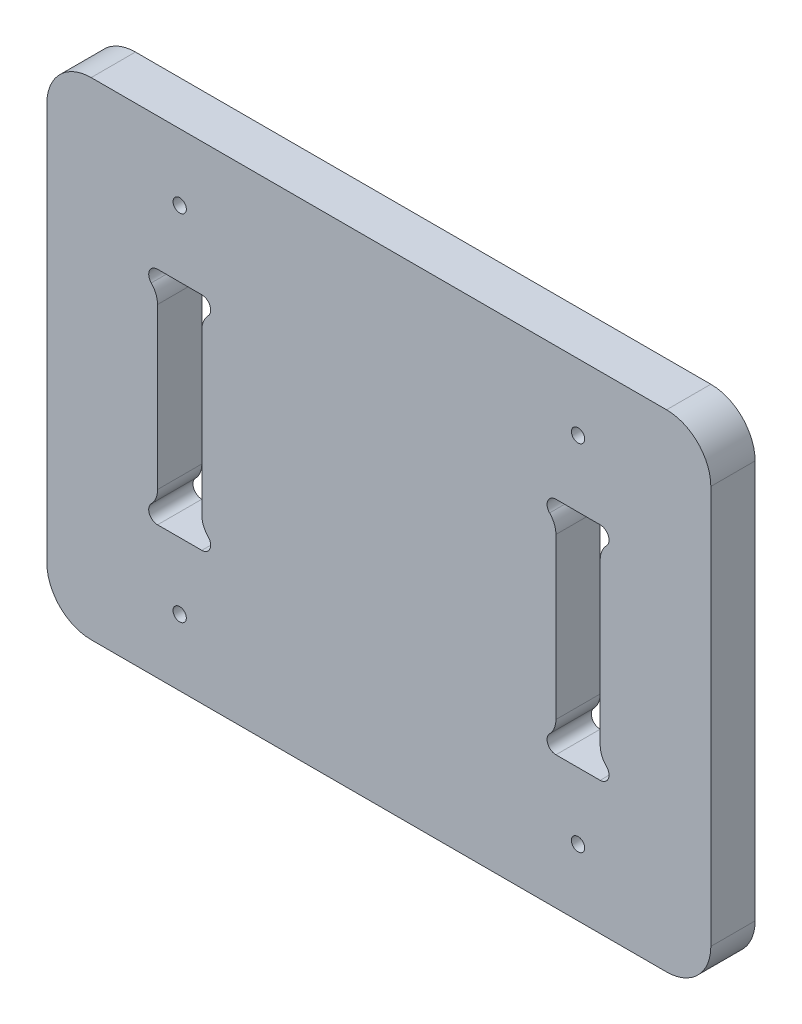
ISO-10303-21;
HEADER;
FILE_DESCRIPTION(('STEP AP214'),'2;1');
FILE_NAME('part.step','',(''),(''),'','','');
FILE_SCHEMA(('AUTOMOTIVE_DESIGN { 1 0 10303 214 1 1 1 1 }'));
ENDSEC;
DATA;
#1=APPLICATION_CONTEXT('core data for automotive mechanical design processes');
#2=APPLICATION_PROTOCOL_DEFINITION('international standard','automotive_design',2000,#1);
#3=PRODUCT_CONTEXT('',#1,'mechanical');
#4=PRODUCT('Part','Part','',(#3));
#5=PRODUCT_RELATED_PRODUCT_CATEGORY('part','',(#4));
#6=PRODUCT_DEFINITION_FORMATION('','',#4);
#7=PRODUCT_DEFINITION_CONTEXT('part definition',#1,'design');
#8=PRODUCT_DEFINITION('design','',#6,#7);
#9=PRODUCT_DEFINITION_SHAPE('','',#8);
#10=(LENGTH_UNIT() NAMED_UNIT(*) SI_UNIT(.MILLI.,.METRE.));
#11=(NAMED_UNIT(*) PLANE_ANGLE_UNIT() SI_UNIT($,.RADIAN.));
#12=(NAMED_UNIT(*) SI_UNIT($,.STERADIAN.) SOLID_ANGLE_UNIT());
#13=UNCERTAINTY_MEASURE_WITH_UNIT(LENGTH_MEASURE(1.E-05),#10,'distance_accuracy_value','');
#14=(GEOMETRIC_REPRESENTATION_CONTEXT(3) GLOBAL_UNCERTAINTY_ASSIGNED_CONTEXT((#13)) GLOBAL_UNIT_ASSIGNED_CONTEXT((#10,
#11,#12)) REPRESENTATION_CONTEXT('',''));
#15=CARTESIAN_POINT('',(0.,0.,0.));
#16=DIRECTION('',(0.,0.,1.));
#17=DIRECTION('',(1.,0.,0.));
#18=AXIS2_PLACEMENT_3D('',#15,#16,#17);
#19=CARTESIAN_POINT('',(9.99999999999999,100.,10.));
#20=DIRECTION('',(0.,0.,-1.));
#21=DIRECTION('',(-1.,0.,0.));
#22=AXIS2_PLACEMENT_3D('',#19,#20,#21);
#23=CYLINDRICAL_SURFACE('',#22,10.);
#24=CARTESIAN_POINT('',(9.99999999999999,100.,0.));
#25=DIRECTION('',(0.,0.,1.));
#26=DIRECTION('',(1.,0.,0.));
#27=AXIS2_PLACEMENT_3D('',#24,#25,#26);
#28=CIRCLE('',#27,10.);
#29=CARTESIAN_POINT('',(10.0000000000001,110.,0.));
#30=VERTEX_POINT('',#29);
#31=CARTESIAN_POINT('',(0.,99.9999999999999,0.));
#32=VERTEX_POINT('',#31);
#33=EDGE_CURVE('E492',#30,#32,#28,.T.);
#34=ORIENTED_EDGE('',*,*,#33,.T.);
#35=DIRECTION('',(0.,0.,-1.));
#36=VECTOR('',#35,1.);
#37=CARTESIAN_POINT('',(0.,99.9999999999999,10.));
#38=LINE('',#37,#36);
#39=CARTESIAN_POINT('',(0.,99.9999999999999,10.));
#40=VERTEX_POINT('',#39);
#41=EDGE_CURVE('E570',#40,#32,#38,.T.);
#42=ORIENTED_EDGE('',*,*,#41,.F.);
#43=CARTESIAN_POINT('',(9.99999999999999,100.,10.));
#44=DIRECTION('',(0.,0.,1.));
#45=DIRECTION('',(1.,0.,0.));
#46=AXIS2_PLACEMENT_3D('',#43,#44,#45);
#47=CIRCLE('',#46,10.);
#48=CARTESIAN_POINT('',(10.0000000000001,110.,10.));
#49=VERTEX_POINT('',#48);
#50=EDGE_CURVE('E493',#49,#40,#47,.T.);
#51=ORIENTED_EDGE('',*,*,#50,.F.);
#52=DIRECTION('',(0.,0.,-1.));
#53=VECTOR('',#52,1.);
#54=CARTESIAN_POINT('',(10.0000000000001,110.,10.));
#55=LINE('',#54,#53);
#56=EDGE_CURVE('E519',#49,#30,#55,.T.);
#57=ORIENTED_EDGE('',*,*,#56,.T.);
#58=EDGE_LOOP('',(#34,#42,#51,#57));
#59=FACE_BOUND('',#58,.T.);
#60=ADVANCED_FACE('F46',(#59),#23,.T.);
#61=CARTESIAN_POINT('',(0.,99.9999999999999,10.));
#62=DIRECTION('',(1.,0.,0.));
#63=DIRECTION('',(0.,1.,0.));
#64=AXIS2_PLACEMENT_3D('',#61,#62,#63);
#65=PLANE('',#64);
#66=DIRECTION('',(0.,-1.,0.));
#67=VECTOR('',#66,1.);
#68=CARTESIAN_POINT('',(0.,99.9999999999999,0.));
#69=LINE('',#68,#67);
#70=CARTESIAN_POINT('',(0.,10.0000000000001,0.));
#71=VERTEX_POINT('',#70);
#72=EDGE_CURVE('E523',#32,#71,#69,.T.);
#73=ORIENTED_EDGE('',*,*,#72,.T.);
#74=DIRECTION('',(0.,0.,-1.));
#75=VECTOR('',#74,1.);
#76=CARTESIAN_POINT('',(0.,10.0000000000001,10.));
#77=LINE('',#76,#75);
#78=CARTESIAN_POINT('',(0.,10.0000000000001,10.));
#79=VERTEX_POINT('',#78);
#80=EDGE_CURVE('E566',#79,#71,#77,.T.);
#81=ORIENTED_EDGE('',*,*,#80,.F.);
#82=DIRECTION('',(0.,-1.,0.));
#83=VECTOR('',#82,1.);
#84=CARTESIAN_POINT('',(0.,99.9999999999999,10.));
#85=LINE('',#84,#83);
#86=EDGE_CURVE('E497',#40,#79,#85,.T.);
#87=ORIENTED_EDGE('',*,*,#86,.F.);
#88=ORIENTED_EDGE('',*,*,#41,.T.);
#89=EDGE_LOOP('',(#73,#81,#87,#88));
#90=FACE_BOUND('',#89,.T.);
#91=ADVANCED_FACE('F624',(#90),#65,.F.);
#92=CARTESIAN_POINT('',(10.,10.,10.));
#93=DIRECTION('',(0.,0.,-1.));
#94=DIRECTION('',(-1.,0.,0.));
#95=AXIS2_PLACEMENT_3D('',#92,#93,#94);
#96=CYLINDRICAL_SURFACE('',#95,10.);
#97=CARTESIAN_POINT('',(10.,10.,0.));
#98=DIRECTION('',(0.,0.,1.));
#99=DIRECTION('',(1.,0.,0.));
#100=AXIS2_PLACEMENT_3D('',#97,#98,#99);
#101=CIRCLE('',#100,10.);
#102=CARTESIAN_POINT('',(10.0000000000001,0.,0.));
#103=VERTEX_POINT('',#102);
#104=EDGE_CURVE('E526',#71,#103,#101,.T.);
#105=ORIENTED_EDGE('',*,*,#104,.T.);
#106=DIRECTION('',(0.,0.,-1.));
#107=VECTOR('',#106,1.);
#108=CARTESIAN_POINT('',(10.0000000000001,0.,10.));
#109=LINE('',#108,#107);
#110=CARTESIAN_POINT('',(10.0000000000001,0.,10.));
#111=VERTEX_POINT('',#110);
#112=EDGE_CURVE('E562',#111,#103,#109,.T.);
#113=ORIENTED_EDGE('',*,*,#112,.F.);
#114=CARTESIAN_POINT('',(10.,10.,10.));
#115=DIRECTION('',(0.,0.,1.));
#116=DIRECTION('',(1.,0.,0.));
#117=AXIS2_PLACEMENT_3D('',#114,#115,#116);
#118=CIRCLE('',#117,10.);
#119=EDGE_CURVE('E501',#79,#111,#118,.T.);
#120=ORIENTED_EDGE('',*,*,#119,.F.);
#121=ORIENTED_EDGE('',*,*,#80,.T.);
#122=EDGE_LOOP('',(#105,#113,#120,#121));
#123=FACE_BOUND('',#122,.T.);
#124=ADVANCED_FACE('F630',(#123),#96,.T.);
#125=CARTESIAN_POINT('',(10.0000000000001,0.,10.));
#126=DIRECTION('',(0.,1.,0.));
#127=DIRECTION('',(0.,0.,1.));
#128=AXIS2_PLACEMENT_3D('',#125,#126,#127);
#129=PLANE('',#128);
#130=DIRECTION('',(1.,0.,0.));
#131=VECTOR('',#130,1.);
#132=CARTESIAN_POINT('',(10.0000000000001,0.,0.));
#133=LINE('',#132,#131);
#134=CARTESIAN_POINT('',(140.,0.,0.));
#135=VERTEX_POINT('',#134);
#136=EDGE_CURVE('E529',#103,#135,#133,.T.);
#137=ORIENTED_EDGE('',*,*,#136,.T.);
#138=DIRECTION('',(0.,0.,-1.));
#139=VECTOR('',#138,1.);
#140=CARTESIAN_POINT('',(140.,0.,10.));
#141=LINE('',#140,#139);
#142=CARTESIAN_POINT('',(140.,0.,10.));
#143=VERTEX_POINT('',#142);
#144=EDGE_CURVE('E558',#143,#135,#141,.T.);
#145=ORIENTED_EDGE('',*,*,#144,.F.);
#146=DIRECTION('',(1.,0.,0.));
#147=VECTOR('',#146,1.);
#148=CARTESIAN_POINT('',(10.0000000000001,0.,10.));
#149=LINE('',#148,#147);
#150=EDGE_CURVE('E504',#111,#143,#149,.T.);
#151=ORIENTED_EDGE('',*,*,#150,.F.);
#152=ORIENTED_EDGE('',*,*,#112,.T.);
#153=EDGE_LOOP('',(#137,#145,#151,#152));
#154=FACE_BOUND('',#153,.T.);
#155=ADVANCED_FACE('F684',(#154),#129,.F.);
#156=CARTESIAN_POINT('',(140.,10.,10.));
#157=DIRECTION('',(0.,0.,-1.));
#158=DIRECTION('',(-1.,0.,0.));
#159=AXIS2_PLACEMENT_3D('',#156,#157,#158);
#160=CYLINDRICAL_SURFACE('',#159,10.);
#161=CARTESIAN_POINT('',(140.,10.,0.));
#162=DIRECTION('',(0.,0.,1.));
#163=DIRECTION('',(1.,0.,0.));
#164=AXIS2_PLACEMENT_3D('',#161,#162,#163);
#165=CIRCLE('',#164,10.);
#166=CARTESIAN_POINT('',(150.,10.0000000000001,0.));
#167=VERTEX_POINT('',#166);
#168=EDGE_CURVE('E532',#135,#167,#165,.T.);
#169=ORIENTED_EDGE('',*,*,#168,.T.);
#170=DIRECTION('',(0.,0.,-1.));
#171=VECTOR('',#170,1.);
#172=CARTESIAN_POINT('',(150.,10.0000000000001,10.));
#173=LINE('',#172,#171);
#174=CARTESIAN_POINT('',(150.,10.0000000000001,10.));
#175=VERTEX_POINT('',#174);
#176=EDGE_CURVE('E554',#175,#167,#173,.T.);
#177=ORIENTED_EDGE('',*,*,#176,.F.);
#178=CARTESIAN_POINT('',(140.,10.,10.));
#179=DIRECTION('',(0.,0.,1.));
#180=DIRECTION('',(1.,0.,0.));
#181=AXIS2_PLACEMENT_3D('',#178,#179,#180);
#182=CIRCLE('',#181,10.);
#183=EDGE_CURVE('E507',#143,#175,#182,.T.);
#184=ORIENTED_EDGE('',*,*,#183,.F.);
#185=ORIENTED_EDGE('',*,*,#144,.T.);
#186=EDGE_LOOP('',(#169,#177,#184,#185));
#187=FACE_BOUND('',#186,.T.);
#188=ADVANCED_FACE('F688',(#187),#160,.T.);
#189=CARTESIAN_POINT('',(150.,99.9999999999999,10.));
#190=DIRECTION('',(-1.,0.,0.));
#191=DIRECTION('',(0.,0.,1.));
#192=AXIS2_PLACEMENT_3D('',#189,#190,#191);
#193=PLANE('',#192);
#194=DIRECTION('',(0.,1.,0.));
#195=VECTOR('',#194,1.);
#196=CARTESIAN_POINT('',(150.,99.9999999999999,0.));
#197=LINE('',#196,#195);
#198=CARTESIAN_POINT('',(150.,99.9999999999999,0.));
#199=VERTEX_POINT('',#198);
#200=EDGE_CURVE('E535',#167,#199,#197,.T.);
#201=ORIENTED_EDGE('',*,*,#200,.T.);
#202=DIRECTION('',(0.,0.,-1.));
#203=VECTOR('',#202,1.);
#204=CARTESIAN_POINT('',(150.,99.9999999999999,10.));
#205=LINE('',#204,#203);
#206=CARTESIAN_POINT('',(150.,99.9999999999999,10.));
#207=VERTEX_POINT('',#206);
#208=EDGE_CURVE('E550',#207,#199,#205,.T.);
#209=ORIENTED_EDGE('',*,*,#208,.F.);
#210=DIRECTION('',(0.,1.,0.));
#211=VECTOR('',#210,1.);
#212=CARTESIAN_POINT('',(150.,99.9999999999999,10.));
#213=LINE('',#212,#211);
#214=EDGE_CURVE('E510',#175,#207,#213,.T.);
#215=ORIENTED_EDGE('',*,*,#214,.F.);
#216=ORIENTED_EDGE('',*,*,#176,.T.);
#217=EDGE_LOOP('',(#201,#209,#215,#216));
#218=FACE_BOUND('',#217,.T.);
#219=ADVANCED_FACE('F693',(#218),#193,.F.);
#220=CARTESIAN_POINT('',(140.,100.,10.));
#221=DIRECTION('',(0.,0.,-1.));
#222=DIRECTION('',(-1.,0.,0.));
#223=AXIS2_PLACEMENT_3D('',#220,#221,#222);
#224=CYLINDRICAL_SURFACE('',#223,10.);
#225=CARTESIAN_POINT('',(140.,100.,0.));
#226=DIRECTION('',(0.,0.,1.));
#227=DIRECTION('',(-1.,0.,0.));
#228=AXIS2_PLACEMENT_3D('',#225,#226,#227);
#229=CIRCLE('',#228,10.);
#230=CARTESIAN_POINT('',(140.,110.,0.));
#231=VERTEX_POINT('',#230);
#232=EDGE_CURVE('E538',#199,#231,#229,.T.);
#233=ORIENTED_EDGE('',*,*,#232,.T.);
#234=DIRECTION('',(0.,0.,-1.));
#235=VECTOR('',#234,1.);
#236=CARTESIAN_POINT('',(140.,110.,10.));
#237=LINE('',#236,#235);
#238=CARTESIAN_POINT('',(140.,110.,10.));
#239=VERTEX_POINT('',#238);
#240=EDGE_CURVE('E546',#239,#231,#237,.T.);
#241=ORIENTED_EDGE('',*,*,#240,.F.);
#242=CARTESIAN_POINT('',(140.,100.,10.));
#243=DIRECTION('',(0.,0.,1.));
#244=DIRECTION('',(-1.,0.,0.));
#245=AXIS2_PLACEMENT_3D('',#242,#243,#244);
#246=CIRCLE('',#245,10.);
#247=EDGE_CURVE('E513',#207,#239,#246,.T.);
#248=ORIENTED_EDGE('',*,*,#247,.F.);
#249=ORIENTED_EDGE('',*,*,#208,.T.);
#250=EDGE_LOOP('',(#233,#241,#248,#249));
#251=FACE_BOUND('',#250,.T.);
#252=ADVANCED_FACE('F697',(#251),#224,.T.);
#253=CARTESIAN_POINT('',(10.0000000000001,110.,10.));
#254=DIRECTION('',(0.,-1.,0.));
#255=DIRECTION('',(0.,0.,-1.));
#256=AXIS2_PLACEMENT_3D('',#253,#254,#255);
#257=PLANE('',#256);
#258=DIRECTION('',(-1.,0.,0.));
#259=VECTOR('',#258,1.);
#260=CARTESIAN_POINT('',(10.0000000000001,110.,0.));
#261=LINE('',#260,#259);
#262=EDGE_CURVE('E498',#231,#30,#261,.T.);
#263=ORIENTED_EDGE('',*,*,#262,.T.);
#264=ORIENTED_EDGE('',*,*,#56,.F.);
#265=DIRECTION('',(-1.,0.,0.));
#266=VECTOR('',#265,1.);
#267=CARTESIAN_POINT('',(10.0000000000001,110.,10.));
#268=LINE('',#267,#266);
#269=EDGE_CURVE('E516',#239,#49,#268,.T.);
#270=ORIENTED_EDGE('',*,*,#269,.F.);
#271=ORIENTED_EDGE('',*,*,#240,.T.);
#272=EDGE_LOOP('',(#263,#264,#270,#271));
#273=FACE_BOUND('',#272,.T.);
#274=ADVANCED_FACE('F666',(#273),#257,.F.);
#275=CARTESIAN_POINT('',(9.99999999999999,100.,10.));
#276=DIRECTION('',(0.,0.,1.));
#277=DIRECTION('',(1.,0.,0.));
#278=AXIS2_PLACEMENT_3D('',#275,#276,#277);
#279=PLANE('',#278);
#280=DIRECTION('',(1.,0.,0.));
#281=VECTOR('',#280,1.);
#282=CARTESIAN_POINT('',(35.,30.,10.));
#283=LINE('',#282,#281);
#284=CARTESIAN_POINT('',(25.,30.,10.));
#285=VERTEX_POINT('',#284);
#286=CARTESIAN_POINT('',(35.,30.,10.));
#287=VERTEX_POINT('',#286);
#288=EDGE_CURVE('E353',#285,#287,#283,.T.);
#289=ORIENTED_EDGE('',*,*,#288,.F.);
#290=CARTESIAN_POINT('',(25.,32.,10.));
#291=DIRECTION('',(0.,0.,1.));
#292=DIRECTION('',(1.,0.,0.));
#293=AXIS2_PLACEMENT_3D('',#290,#291,#292);
#294=CIRCLE('',#293,2.);
#295=CARTESIAN_POINT('',(23.5714285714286,33.3997084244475,10.));
#296=VERTEX_POINT('',#295);
#297=EDGE_CURVE('E276',#296,#285,#294,.T.);
#298=ORIENTED_EDGE('',*,*,#297,.F.);
#299=CARTESIAN_POINT('',(20.,36.8989794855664,10.));
#300=DIRECTION('',(0.,0.,-1.));
#301=DIRECTION('',(1.,0.,0.));
#302=AXIS2_PLACEMENT_3D('',#299,#300,#301);
#303=CIRCLE('',#302,5.);
#304=CARTESIAN_POINT('',(25.,36.8989794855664,10.));
#305=VERTEX_POINT('',#304);
#306=EDGE_CURVE('E324',#305,#296,#303,.T.);
#307=ORIENTED_EDGE('',*,*,#306,.F.);
#308=DIRECTION('',(0.,-1.,0.));
#309=VECTOR('',#308,1.);
#310=CARTESIAN_POINT('',(25.,36.8989794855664,10.));
#311=LINE('',#310,#309);
#312=CARTESIAN_POINT('',(25.,73.1010205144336,10.));
#313=VERTEX_POINT('',#312);
#314=EDGE_CURVE('E262',#313,#305,#311,.T.);
#315=ORIENTED_EDGE('',*,*,#314,.F.);
#316=CARTESIAN_POINT('',(20.,73.1010205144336,10.));
#317=DIRECTION('',(0.,0.,-1.));
#318=DIRECTION('',(1.,0.,0.));
#319=AXIS2_PLACEMENT_3D('',#316,#317,#318);
#320=CIRCLE('',#319,5.);
#321=CARTESIAN_POINT('',(23.5714285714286,76.6002915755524,10.));
#322=VERTEX_POINT('',#321);
#323=EDGE_CURVE('E329',#322,#313,#320,.T.);
#324=ORIENTED_EDGE('',*,*,#323,.F.);
#325=CARTESIAN_POINT('',(25.,78.,10.));
#326=DIRECTION('',(0.,0.,1.));
#327=DIRECTION('',(1.,0.,0.));
#328=AXIS2_PLACEMENT_3D('',#325,#326,#327);
#329=CIRCLE('',#328,2.00000000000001);
#330=CARTESIAN_POINT('',(25.,80.,10.));
#331=VERTEX_POINT('',#330);
#332=EDGE_CURVE('E332',#331,#322,#329,.T.);
#333=ORIENTED_EDGE('',*,*,#332,.F.);
#334=DIRECTION('',(-1.,0.,0.));
#335=VECTOR('',#334,1.);
#336=CARTESIAN_POINT('',(25.,80.,10.));
#337=LINE('',#336,#335);
#338=CARTESIAN_POINT('',(35.,80.,10.));
#339=VERTEX_POINT('',#338);
#340=EDGE_CURVE('E335',#339,#331,#337,.T.);
#341=ORIENTED_EDGE('',*,*,#340,.F.);
#342=CARTESIAN_POINT('',(35.,78.,10.));
#343=DIRECTION('',(0.,0.,1.));
#344=DIRECTION('',(-1.,0.,0.));
#345=AXIS2_PLACEMENT_3D('',#342,#343,#344);
#346=CIRCLE('',#345,2.00000000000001);
#347=CARTESIAN_POINT('',(36.4285714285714,76.6002915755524,10.));
#348=VERTEX_POINT('',#347);
#349=EDGE_CURVE('E338',#348,#339,#346,.T.);
#350=ORIENTED_EDGE('',*,*,#349,.F.);
#351=CARTESIAN_POINT('',(40.,73.1010205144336,10.));
#352=DIRECTION('',(0.,0.,-1.));
#353=DIRECTION('',(-1.,0.,0.));
#354=AXIS2_PLACEMENT_3D('',#351,#352,#353);
#355=CIRCLE('',#354,5.);
#356=CARTESIAN_POINT('',(35.,73.1010205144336,10.));
#357=VERTEX_POINT('',#356);
#358=EDGE_CURVE('E341',#357,#348,#355,.T.);
#359=ORIENTED_EDGE('',*,*,#358,.F.);
#360=DIRECTION('',(0.,1.,0.));
#361=VECTOR('',#360,1.);
#362=CARTESIAN_POINT('',(35.,36.8989794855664,10.));
#363=LINE('',#362,#361);
#364=CARTESIAN_POINT('',(35.,36.8989794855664,10.));
#365=VERTEX_POINT('',#364);
#366=EDGE_CURVE('E344',#365,#357,#363,.T.);
#367=ORIENTED_EDGE('',*,*,#366,.F.);
#368=CARTESIAN_POINT('',(40.,36.8989794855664,10.));
#369=DIRECTION('',(0.,0.,-1.));
#370=DIRECTION('',(-1.,0.,0.));
#371=AXIS2_PLACEMENT_3D('',#368,#369,#370);
#372=CIRCLE('',#371,5.);
#373=CARTESIAN_POINT('',(36.4285714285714,33.3997084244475,10.));
#374=VERTEX_POINT('',#373);
#375=EDGE_CURVE('E347',#374,#365,#372,.T.);
#376=ORIENTED_EDGE('',*,*,#375,.F.);
#377=CARTESIAN_POINT('',(35.,32.,10.));
#378=DIRECTION('',(0.,0.,1.));
#379=DIRECTION('',(-1.,0.,0.));
#380=AXIS2_PLACEMENT_3D('',#377,#378,#379);
#381=CIRCLE('',#380,2.);
#382=EDGE_CURVE('E350',#287,#374,#381,.T.);
#383=ORIENTED_EDGE('',*,*,#382,.F.);
#384=EDGE_LOOP('',(#289,#298,#307,#315,#324,#333,#341,#350,#359,#367,#376,#383));
#385=FACE_BOUND('',#384,.T.);
#386=CARTESIAN_POINT('',(30.,15.,10.));
#387=DIRECTION('',(0.,0.,1.));
#388=DIRECTION('',(1.,0.,0.));
#389=AXIS2_PLACEMENT_3D('',#386,#387,#388);
#390=CIRCLE('',#389,1.5);
#391=CARTESIAN_POINT('',(31.5,15.,10.));
#392=VERTEX_POINT('',#391);
#393=EDGE_CURVE('E358',#392,#392,#390,.T.);
#394=ORIENTED_EDGE('',*,*,#393,.F.);
#395=EDGE_LOOP('',(#394));
#396=FACE_BOUND('',#395,.T.);
#397=CARTESIAN_POINT('',(120.,95.,10.));
#398=DIRECTION('',(0.,0.,1.));
#399=DIRECTION('',(-1.,0.,0.));
#400=AXIS2_PLACEMENT_3D('',#397,#398,#399);
#401=CIRCLE('',#400,1.5);
#402=CARTESIAN_POINT('',(118.5,95.,10.));
#403=VERTEX_POINT('',#402);
#404=EDGE_CURVE('E363',#403,#403,#401,.T.);
#405=ORIENTED_EDGE('',*,*,#404,.F.);
#406=EDGE_LOOP('',(#405));
#407=FACE_BOUND('',#406,.T.);
#408=DIRECTION('',(1.,0.,0.));
#409=VECTOR('',#408,1.);
#410=CARTESIAN_POINT('',(125.,30.,10.));
#411=LINE('',#410,#409);
#412=CARTESIAN_POINT('',(115.,30.,10.));
#413=VERTEX_POINT('',#412);
#414=CARTESIAN_POINT('',(125.,30.,10.));
#415=VERTEX_POINT('',#414);
#416=EDGE_CURVE('E484',#413,#415,#411,.T.);
#417=ORIENTED_EDGE('',*,*,#416,.F.);
#418=CARTESIAN_POINT('',(115.,32.,10.));
#419=DIRECTION('',(0.,0.,1.));
#420=DIRECTION('',(1.,0.,0.));
#421=AXIS2_PLACEMENT_3D('',#418,#419,#420);
#422=CIRCLE('',#421,2.);
#423=CARTESIAN_POINT('',(113.571428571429,33.3997084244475,10.));
#424=VERTEX_POINT('',#423);
#425=EDGE_CURVE('E412',#424,#413,#422,.T.);
#426=ORIENTED_EDGE('',*,*,#425,.F.);
#427=CARTESIAN_POINT('',(110.,36.8989794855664,10.));
#428=DIRECTION('',(0.,0.,-1.));
#429=DIRECTION('',(1.,0.,0.));
#430=AXIS2_PLACEMENT_3D('',#427,#428,#429);
#431=CIRCLE('',#430,5.);
#432=CARTESIAN_POINT('',(115.,36.8989794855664,10.));
#433=VERTEX_POINT('',#432);
#434=EDGE_CURVE('E406',#433,#424,#431,.T.);
#435=ORIENTED_EDGE('',*,*,#434,.F.);
#436=DIRECTION('',(0.,-1.,0.));
#437=VECTOR('',#436,1.);
#438=CARTESIAN_POINT('',(115.,36.8989794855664,10.));
#439=LINE('',#438,#437);
#440=CARTESIAN_POINT('',(115.,73.1010205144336,10.));
#441=VERTEX_POINT('',#440);
#442=EDGE_CURVE('E457',#441,#433,#439,.T.);
#443=ORIENTED_EDGE('',*,*,#442,.F.);
#444=CARTESIAN_POINT('',(110.,73.1010205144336,10.));
#445=DIRECTION('',(0.,0.,-1.));
#446=DIRECTION('',(1.,0.,0.));
#447=AXIS2_PLACEMENT_3D('',#444,#445,#446);
#448=CIRCLE('',#447,5.00000000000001);
#449=CARTESIAN_POINT('',(113.571428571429,76.6002915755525,10.));
#450=VERTEX_POINT('',#449);
#451=EDGE_CURVE('E460',#450,#441,#448,.T.);
#452=ORIENTED_EDGE('',*,*,#451,.F.);
#453=CARTESIAN_POINT('',(115.,78.,10.));
#454=DIRECTION('',(0.,0.,1.));
#455=DIRECTION('',(1.,0.,0.));
#456=AXIS2_PLACEMENT_3D('',#453,#454,#455);
#457=CIRCLE('',#456,1.99999999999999);
#458=CARTESIAN_POINT('',(115.,80.,10.));
#459=VERTEX_POINT('',#458);
#460=EDGE_CURVE('E463',#459,#450,#457,.T.);
#461=ORIENTED_EDGE('',*,*,#460,.F.);
#462=DIRECTION('',(-1.,0.,0.));
#463=VECTOR('',#462,1.);
#464=CARTESIAN_POINT('',(115.,80.,10.));
#465=LINE('',#464,#463);
#466=CARTESIAN_POINT('',(125.,80.,10.));
#467=VERTEX_POINT('',#466);
#468=EDGE_CURVE('E466',#467,#459,#465,.T.);
#469=ORIENTED_EDGE('',*,*,#468,.F.);
#470=CARTESIAN_POINT('',(125.,78.,10.));
#471=DIRECTION('',(0.,0.,1.));
#472=DIRECTION('',(-1.,0.,0.));
#473=AXIS2_PLACEMENT_3D('',#470,#471,#472);
#474=CIRCLE('',#473,1.99999999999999);
#475=CARTESIAN_POINT('',(126.428571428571,76.6002915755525,10.));
#476=VERTEX_POINT('',#475);
#477=EDGE_CURVE('E469',#476,#467,#474,.T.);
#478=ORIENTED_EDGE('',*,*,#477,.F.);
#479=CARTESIAN_POINT('',(130.,73.1010205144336,10.));
#480=DIRECTION('',(0.,0.,-1.));
#481=DIRECTION('',(-1.,0.,0.));
#482=AXIS2_PLACEMENT_3D('',#479,#480,#481);
#483=CIRCLE('',#482,5.00000000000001);
#484=CARTESIAN_POINT('',(125.,73.1010205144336,10.));
#485=VERTEX_POINT('',#484);
#486=EDGE_CURVE('E472',#485,#476,#483,.T.);
#487=ORIENTED_EDGE('',*,*,#486,.F.);
#488=DIRECTION('',(0.,1.,0.));
#489=VECTOR('',#488,1.);
#490=CARTESIAN_POINT('',(125.,36.8989794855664,10.));
#491=LINE('',#490,#489);
#492=CARTESIAN_POINT('',(125.,36.8989794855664,10.));
#493=VERTEX_POINT('',#492);
#494=EDGE_CURVE('E475',#493,#485,#491,.T.);
#495=ORIENTED_EDGE('',*,*,#494,.F.);
#496=CARTESIAN_POINT('',(130.,36.8989794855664,10.));
#497=DIRECTION('',(0.,0.,-1.));
#498=DIRECTION('',(-1.,0.,0.));
#499=AXIS2_PLACEMENT_3D('',#496,#497,#498);
#500=CIRCLE('',#499,5.00000000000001);
#501=CARTESIAN_POINT('',(126.428571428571,33.3997084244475,10.));
#502=VERTEX_POINT('',#501);
#503=EDGE_CURVE('E478',#502,#493,#500,.T.);
#504=ORIENTED_EDGE('',*,*,#503,.F.);
#505=CARTESIAN_POINT('',(125.,32.,10.));
#506=DIRECTION('',(0.,0.,1.));
#507=DIRECTION('',(-1.,0.,0.));
#508=AXIS2_PLACEMENT_3D('',#505,#506,#507);
#509=CIRCLE('',#508,2.);
#510=EDGE_CURVE('E481',#415,#502,#509,.T.);
#511=ORIENTED_EDGE('',*,*,#510,.F.);
#512=EDGE_LOOP('',(#417,#426,#435,#443,#452,#461,#469,#478,#487,#495,#504,#511));
#513=FACE_BOUND('',#512,.T.);
#514=CARTESIAN_POINT('',(120.,15.,10.));
#515=DIRECTION('',(0.,0.,1.));
#516=DIRECTION('',(1.,0.,0.));
#517=AXIS2_PLACEMENT_3D('',#514,#515,#516);
#518=CIRCLE('',#517,1.50000000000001);
#519=CARTESIAN_POINT('',(121.5,15.,10.));
#520=VERTEX_POINT('',#519);
#521=EDGE_CURVE('E373',#520,#520,#518,.T.);
#522=ORIENTED_EDGE('',*,*,#521,.F.);
#523=EDGE_LOOP('',(#522));
#524=FACE_BOUND('',#523,.T.);
#525=CARTESIAN_POINT('',(30.,95.,10.));
#526=DIRECTION('',(0.,0.,1.));
#527=DIRECTION('',(-1.,0.,0.));
#528=AXIS2_PLACEMENT_3D('',#525,#526,#527);
#529=CIRCLE('',#528,1.5);
#530=CARTESIAN_POINT('',(28.5,95.,10.));
#531=VERTEX_POINT('',#530);
#532=EDGE_CURVE('E323',#531,#531,#529,.T.);
#533=ORIENTED_EDGE('',*,*,#532,.F.);
#534=EDGE_LOOP('',(#533));
#535=FACE_BOUND('',#534,.T.);
#536=ORIENTED_EDGE('',*,*,#50,.T.);
#537=ORIENTED_EDGE('',*,*,#86,.T.);
#538=ORIENTED_EDGE('',*,*,#119,.T.);
#539=ORIENTED_EDGE('',*,*,#150,.T.);
#540=ORIENTED_EDGE('',*,*,#183,.T.);
#541=ORIENTED_EDGE('',*,*,#214,.T.);
#542=ORIENTED_EDGE('',*,*,#247,.T.);
#543=ORIENTED_EDGE('',*,*,#269,.T.);
#544=EDGE_LOOP('',(#536,#537,#538,#539,#540,#541,#542,#543));
#545=FACE_BOUND('',#544,.T.);
#546=ADVANCED_FACE('F613',(#385,#396,#407,#513,#524,#535,#545),#279,.T.);
#547=CARTESIAN_POINT('',(9.99999999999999,100.,0.));
#548=DIRECTION('',(0.,0.,1.));
#549=DIRECTION('',(1.,0.,0.));
#550=AXIS2_PLACEMENT_3D('',#547,#548,#549);
#551=PLANE('',#550);
#552=CARTESIAN_POINT('',(120.,95.,0.));
#553=DIRECTION('',(0.,0.,1.));
#554=DIRECTION('',(1.,0.,0.));
#555=AXIS2_PLACEMENT_3D('',#552,#553,#554);
#556=CIRCLE('',#555,3.70000000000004);
#557=CARTESIAN_POINT('',(123.7,95.,0.));
#558=VERTEX_POINT('',#557);
#559=EDGE_CURVE('E586',#558,#558,#556,.T.);
#560=ORIENTED_EDGE('',*,*,#559,.T.);
#561=EDGE_LOOP('',(#560));
#562=FACE_BOUND('',#561,.T.);
#563=CARTESIAN_POINT('',(30.,95.,0.));
#564=DIRECTION('',(0.,0.,1.));
#565=DIRECTION('',(1.,0.,0.));
#566=AXIS2_PLACEMENT_3D('',#563,#564,#565);
#567=CIRCLE('',#566,3.70000000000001);
#568=CARTESIAN_POINT('',(33.7,95.,0.));
#569=VERTEX_POINT('',#568);
#570=EDGE_CURVE('E582',#569,#569,#567,.T.);
#571=ORIENTED_EDGE('',*,*,#570,.T.);
#572=EDGE_LOOP('',(#571));
#573=FACE_BOUND('',#572,.T.);
#574=CARTESIAN_POINT('',(120.,15.,0.));
#575=DIRECTION('',(0.,0.,1.));
#576=DIRECTION('',(1.,0.,0.));
#577=AXIS2_PLACEMENT_3D('',#574,#575,#576);
#578=CIRCLE('',#577,3.70000000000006);
#579=CARTESIAN_POINT('',(123.7,15.,0.));
#580=VERTEX_POINT('',#579);
#581=EDGE_CURVE('E578',#580,#580,#578,.T.);
#582=ORIENTED_EDGE('',*,*,#581,.T.);
#583=EDGE_LOOP('',(#582));
#584=FACE_BOUND('',#583,.T.);
#585=CARTESIAN_POINT('',(30.,15.,0.));
#586=DIRECTION('',(0.,0.,1.));
#587=DIRECTION('',(1.,0.,0.));
#588=AXIS2_PLACEMENT_3D('',#585,#586,#587);
#589=CIRCLE('',#588,3.70000000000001);
#590=CARTESIAN_POINT('',(33.7,15.,0.));
#591=VERTEX_POINT('',#590);
#592=EDGE_CURVE('E574',#591,#591,#589,.T.);
#593=ORIENTED_EDGE('',*,*,#592,.T.);
#594=EDGE_LOOP('',(#593));
#595=FACE_BOUND('',#594,.T.);
#596=CARTESIAN_POINT('',(25.,32.,0.));
#597=DIRECTION('',(0.,0.,1.));
#598=DIRECTION('',(1.,0.,0.));
#599=AXIS2_PLACEMENT_3D('',#596,#597,#598);
#600=CIRCLE('',#599,2.);
#601=CARTESIAN_POINT('',(23.5714285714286,33.3997084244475,0.));
#602=VERTEX_POINT('',#601);
#603=CARTESIAN_POINT('',(25.,30.,0.));
#604=VERTEX_POINT('',#603);
#605=EDGE_CURVE('E320',#602,#604,#600,.T.);
#606=ORIENTED_EDGE('',*,*,#605,.T.);
#607=DIRECTION('',(1.,0.,0.));
#608=VECTOR('',#607,1.);
#609=CARTESIAN_POINT('',(35.,30.,0.));
#610=LINE('',#609,#608);
#611=CARTESIAN_POINT('',(35.,30.,0.));
#612=VERTEX_POINT('',#611);
#613=EDGE_CURVE('E316',#604,#612,#610,.T.);
#614=ORIENTED_EDGE('',*,*,#613,.T.);
#615=CARTESIAN_POINT('',(35.,32.,0.));
#616=DIRECTION('',(0.,0.,1.));
#617=DIRECTION('',(-1.,0.,0.));
#618=AXIS2_PLACEMENT_3D('',#615,#616,#617);
#619=CIRCLE('',#618,2.);
#620=CARTESIAN_POINT('',(36.4285714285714,33.3997084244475,0.));
#621=VERTEX_POINT('',#620);
#622=EDGE_CURVE('E312',#612,#621,#619,.T.);
#623=ORIENTED_EDGE('',*,*,#622,.T.);
#624=CARTESIAN_POINT('',(40.,36.8989794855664,0.));
#625=DIRECTION('',(0.,0.,-1.));
#626=DIRECTION('',(-1.,0.,0.));
#627=AXIS2_PLACEMENT_3D('',#624,#625,#626);
#628=CIRCLE('',#627,5.);
#629=CARTESIAN_POINT('',(35.,36.8989794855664,0.));
#630=VERTEX_POINT('',#629);
#631=EDGE_CURVE('E308',#621,#630,#628,.T.);
#632=ORIENTED_EDGE('',*,*,#631,.T.);
#633=DIRECTION('',(0.,1.,0.));
#634=VECTOR('',#633,1.);
#635=CARTESIAN_POINT('',(35.,36.8989794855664,0.));
#636=LINE('',#635,#634);
#637=CARTESIAN_POINT('',(35.,73.1010205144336,0.));
#638=VERTEX_POINT('',#637);
#639=EDGE_CURVE('E304',#630,#638,#636,.T.);
#640=ORIENTED_EDGE('',*,*,#639,.T.);
#641=CARTESIAN_POINT('',(40.,73.1010205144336,0.));
#642=DIRECTION('',(0.,0.,-1.));
#643=DIRECTION('',(-1.,0.,0.));
#644=AXIS2_PLACEMENT_3D('',#641,#642,#643);
#645=CIRCLE('',#644,5.);
#646=CARTESIAN_POINT('',(36.4285714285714,76.6002915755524,0.));
#647=VERTEX_POINT('',#646);
#648=EDGE_CURVE('E300',#638,#647,#645,.T.);
#649=ORIENTED_EDGE('',*,*,#648,.T.);
#650=CARTESIAN_POINT('',(35.,78.,0.));
#651=DIRECTION('',(0.,0.,1.));
#652=DIRECTION('',(-1.,0.,0.));
#653=AXIS2_PLACEMENT_3D('',#650,#651,#652);
#654=CIRCLE('',#653,2.00000000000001);
#655=CARTESIAN_POINT('',(35.,80.,0.));
#656=VERTEX_POINT('',#655);
#657=EDGE_CURVE('E296',#647,#656,#654,.T.);
#658=ORIENTED_EDGE('',*,*,#657,.T.);
#659=DIRECTION('',(-1.,0.,0.));
#660=VECTOR('',#659,1.);
#661=CARTESIAN_POINT('',(25.,80.,0.));
#662=LINE('',#661,#660);
#663=CARTESIAN_POINT('',(25.,80.,0.));
#664=VERTEX_POINT('',#663);
#665=EDGE_CURVE('E292',#656,#664,#662,.T.);
#666=ORIENTED_EDGE('',*,*,#665,.T.);
#667=CARTESIAN_POINT('',(25.,78.,0.));
#668=DIRECTION('',(0.,0.,1.));
#669=DIRECTION('',(1.,0.,0.));
#670=AXIS2_PLACEMENT_3D('',#667,#668,#669);
#671=CIRCLE('',#670,2.00000000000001);
#672=CARTESIAN_POINT('',(23.5714285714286,76.6002915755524,0.));
#673=VERTEX_POINT('',#672);
#674=EDGE_CURVE('E286',#664,#673,#671,.T.);
#675=ORIENTED_EDGE('',*,*,#674,.T.);
#676=CARTESIAN_POINT('',(20.,73.1010205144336,0.));
#677=DIRECTION('',(0.,0.,-1.));
#678=DIRECTION('',(1.,0.,0.));
#679=AXIS2_PLACEMENT_3D('',#676,#677,#678);
#680=CIRCLE('',#679,5.);
#681=CARTESIAN_POINT('',(25.,73.1010205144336,0.));
#682=VERTEX_POINT('',#681);
#683=EDGE_CURVE('E282',#673,#682,#680,.T.);
#684=ORIENTED_EDGE('',*,*,#683,.T.);
#685=DIRECTION('',(0.,-1.,0.));
#686=VECTOR('',#685,1.);
#687=CARTESIAN_POINT('',(25.,36.8989794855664,0.));
#688=LINE('',#687,#686);
#689=CARTESIAN_POINT('',(25.,36.8989794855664,0.));
#690=VERTEX_POINT('',#689);
#691=EDGE_CURVE('E259',#682,#690,#688,.T.);
#692=ORIENTED_EDGE('',*,*,#691,.T.);
#693=CARTESIAN_POINT('',(20.,36.8989794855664,0.));
#694=DIRECTION('',(0.,0.,-1.));
#695=DIRECTION('',(1.,0.,0.));
#696=AXIS2_PLACEMENT_3D('',#693,#694,#695);
#697=CIRCLE('',#696,5.);
#698=EDGE_CURVE('E270',#690,#602,#697,.T.);
#699=ORIENTED_EDGE('',*,*,#698,.T.);
#700=EDGE_LOOP('',(#606,#614,#623,#632,#640,#649,#658,#666,#675,#684,#692,#699));
#701=FACE_BOUND('',#700,.T.);
#702=CARTESIAN_POINT('',(115.,32.,0.));
#703=DIRECTION('',(0.,0.,1.));
#704=DIRECTION('',(1.,0.,0.));
#705=AXIS2_PLACEMENT_3D('',#702,#703,#704);
#706=CIRCLE('',#705,2.);
#707=CARTESIAN_POINT('',(113.571428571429,33.3997084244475,0.));
#708=VERTEX_POINT('',#707);
#709=CARTESIAN_POINT('',(115.,30.,0.));
#710=VERTEX_POINT('',#709);
#711=EDGE_CURVE('E367',#708,#710,#706,.T.);
#712=ORIENTED_EDGE('',*,*,#711,.T.);
#713=DIRECTION('',(1.,0.,0.));
#714=VECTOR('',#713,1.);
#715=CARTESIAN_POINT('',(125.,30.,0.));
#716=LINE('',#715,#714);
#717=CARTESIAN_POINT('',(125.,30.,0.));
#718=VERTEX_POINT('',#717);
#719=EDGE_CURVE('E448',#710,#718,#716,.T.);
#720=ORIENTED_EDGE('',*,*,#719,.T.);
#721=CARTESIAN_POINT('',(125.,32.,0.));
#722=DIRECTION('',(0.,0.,1.));
#723=DIRECTION('',(-1.,0.,0.));
#724=AXIS2_PLACEMENT_3D('',#721,#722,#723);
#725=CIRCLE('',#724,2.);
#726=CARTESIAN_POINT('',(126.428571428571,33.3997084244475,0.));
#727=VERTEX_POINT('',#726);
#728=EDGE_CURVE('E444',#718,#727,#725,.T.);
#729=ORIENTED_EDGE('',*,*,#728,.T.);
#730=CARTESIAN_POINT('',(130.,36.8989794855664,0.));
#731=DIRECTION('',(0.,0.,-1.));
#732=DIRECTION('',(-1.,0.,0.));
#733=AXIS2_PLACEMENT_3D('',#730,#731,#732);
#734=CIRCLE('',#733,5.00000000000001);
#735=CARTESIAN_POINT('',(125.,36.8989794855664,0.));
#736=VERTEX_POINT('',#735);
#737=EDGE_CURVE('E440',#727,#736,#734,.T.);
#738=ORIENTED_EDGE('',*,*,#737,.T.);
#739=DIRECTION('',(0.,1.,0.));
#740=VECTOR('',#739,1.);
#741=CARTESIAN_POINT('',(125.,36.8989794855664,0.));
#742=LINE('',#741,#740);
#743=CARTESIAN_POINT('',(125.,73.1010205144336,0.));
#744=VERTEX_POINT('',#743);
#745=EDGE_CURVE('E436',#736,#744,#742,.T.);
#746=ORIENTED_EDGE('',*,*,#745,.T.);
#747=CARTESIAN_POINT('',(130.,73.1010205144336,0.));
#748=DIRECTION('',(0.,0.,-1.));
#749=DIRECTION('',(-1.,0.,0.));
#750=AXIS2_PLACEMENT_3D('',#747,#748,#749);
#751=CIRCLE('',#750,5.00000000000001);
#752=CARTESIAN_POINT('',(126.428571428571,76.6002915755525,0.));
#753=VERTEX_POINT('',#752);
#754=EDGE_CURVE('E432',#744,#753,#751,.T.);
#755=ORIENTED_EDGE('',*,*,#754,.T.);
#756=CARTESIAN_POINT('',(125.,78.,0.));
#757=DIRECTION('',(0.,0.,1.));
#758=DIRECTION('',(-1.,0.,0.));
#759=AXIS2_PLACEMENT_3D('',#756,#757,#758);
#760=CIRCLE('',#759,1.99999999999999);
#761=CARTESIAN_POINT('',(125.,80.,0.));
#762=VERTEX_POINT('',#761);
#763=EDGE_CURVE('E428',#753,#762,#760,.T.);
#764=ORIENTED_EDGE('',*,*,#763,.T.);
#765=DIRECTION('',(-1.,0.,0.));
#766=VECTOR('',#765,1.);
#767=CARTESIAN_POINT('',(115.,80.,0.));
#768=LINE('',#767,#766);
#769=CARTESIAN_POINT('',(115.,80.,0.));
#770=VERTEX_POINT('',#769);
#771=EDGE_CURVE('E424',#762,#770,#768,.T.);
#772=ORIENTED_EDGE('',*,*,#771,.T.);
#773=CARTESIAN_POINT('',(115.,78.,0.));
#774=DIRECTION('',(0.,0.,1.));
#775=DIRECTION('',(1.,0.,0.));
#776=AXIS2_PLACEMENT_3D('',#773,#774,#775);
#777=CIRCLE('',#776,1.99999999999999);
#778=CARTESIAN_POINT('',(113.571428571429,76.6002915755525,0.));
#779=VERTEX_POINT('',#778);
#780=EDGE_CURVE('E420',#770,#779,#777,.T.);
#781=ORIENTED_EDGE('',*,*,#780,.T.);
#782=CARTESIAN_POINT('',(110.,73.1010205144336,0.));
#783=DIRECTION('',(0.,0.,-1.));
#784=DIRECTION('',(1.,0.,0.));
#785=AXIS2_PLACEMENT_3D('',#782,#783,#784);
#786=CIRCLE('',#785,5.00000000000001);
#787=CARTESIAN_POINT('',(115.,73.1010205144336,0.));
#788=VERTEX_POINT('',#787);
#789=EDGE_CURVE('E416',#779,#788,#786,.T.);
#790=ORIENTED_EDGE('',*,*,#789,.T.);
#791=DIRECTION('',(0.,-1.,0.));
#792=VECTOR('',#791,1.);
#793=CARTESIAN_POINT('',(115.,36.8989794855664,0.));
#794=LINE('',#793,#792);
#795=CARTESIAN_POINT('',(115.,36.8989794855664,0.));
#796=VERTEX_POINT('',#795);
#797=EDGE_CURVE('E411',#788,#796,#794,.T.);
#798=ORIENTED_EDGE('',*,*,#797,.T.);
#799=CARTESIAN_POINT('',(110.,36.8989794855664,0.));
#800=DIRECTION('',(0.,0.,-1.));
#801=DIRECTION('',(1.,0.,0.));
#802=AXIS2_PLACEMENT_3D('',#799,#800,#801);
#803=CIRCLE('',#802,5.);
#804=EDGE_CURVE('E407',#796,#708,#803,.T.);
#805=ORIENTED_EDGE('',*,*,#804,.T.);
#806=EDGE_LOOP('',(#712,#720,#729,#738,#746,#755,#764,#772,#781,#790,#798,#805));
#807=FACE_BOUND('',#806,.T.);
#808=ORIENTED_EDGE('',*,*,#33,.F.);
#809=ORIENTED_EDGE('',*,*,#262,.F.);
#810=ORIENTED_EDGE('',*,*,#232,.F.);
#811=ORIENTED_EDGE('',*,*,#200,.F.);
#812=ORIENTED_EDGE('',*,*,#168,.F.);
#813=ORIENTED_EDGE('',*,*,#136,.F.);
#814=ORIENTED_EDGE('',*,*,#104,.F.);
#815=ORIENTED_EDGE('',*,*,#72,.F.);
#816=EDGE_LOOP('',(#808,#809,#810,#811,#812,#813,#814,#815));
#817=FACE_BOUND('',#816,.T.);
#818=ADVANCED_FACE('F278',(#562,#573,#584,#595,#701,#807,#817),#551,.F.);
#819=CARTESIAN_POINT('',(30.,95.,10.));
#820=DIRECTION('',(0.,0.,-1.));
#821=DIRECTION('',(-1.,0.,0.));
#822=AXIS2_PLACEMENT_3D('',#819,#820,#821);
#823=CYLINDRICAL_SURFACE('',#822,1.5);
#824=CARTESIAN_POINT('',(30.,95.,2.20000000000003));
#825=DIRECTION('',(0.,0.,1.));
#826=DIRECTION('',(1.,0.,0.));
#827=AXIS2_PLACEMENT_3D('',#824,#825,#826);
#828=CIRCLE('',#827,1.5);
#829=CARTESIAN_POINT('',(31.5,95.,2.20000000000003));
#830=VERTEX_POINT('',#829);
#831=EDGE_CURVE('E594',#830,#830,#828,.F.);
#832=ORIENTED_EDGE('',*,*,#831,.T.);
#833=EDGE_LOOP('',(#832));
#834=FACE_BOUND('',#833,.T.);
#835=ORIENTED_EDGE('',*,*,#532,.T.);
#836=EDGE_LOOP('',(#835));
#837=FACE_BOUND('',#836,.T.);
#838=ADVANCED_FACE('F612',(#834,#837),#823,.F.);
#839=CARTESIAN_POINT('',(120.,15.,10.));
#840=DIRECTION('',(0.,0.,-1.));
#841=DIRECTION('',(-1.,0.,0.));
#842=AXIS2_PLACEMENT_3D('',#839,#840,#841);
#843=CYLINDRICAL_SURFACE('',#842,1.50000000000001);
#844=CARTESIAN_POINT('',(120.,15.,2.20000000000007));
#845=DIRECTION('',(0.,0.,1.));
#846=DIRECTION('',(1.,0.,0.));
#847=AXIS2_PLACEMENT_3D('',#844,#845,#846);
#848=CIRCLE('',#847,1.50000000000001);
#849=CARTESIAN_POINT('',(121.5,15.,2.20000000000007));
#850=VERTEX_POINT('',#849);
#851=EDGE_CURVE('E56',#850,#850,#848,.F.);
#852=ORIENTED_EDGE('',*,*,#851,.T.);
#853=EDGE_LOOP('',(#852));
#854=FACE_BOUND('',#853,.T.);
#855=ORIENTED_EDGE('',*,*,#521,.T.);
#856=EDGE_LOOP('',(#855));
#857=FACE_BOUND('',#856,.T.);
#858=ADVANCED_FACE('F601',(#854,#857),#843,.F.);
#859=CARTESIAN_POINT('',(115.,32.,10.));
#860=DIRECTION('',(0.,0.,-1.));
#861=DIRECTION('',(-1.,0.,0.));
#862=AXIS2_PLACEMENT_3D('',#859,#860,#861);
#863=CYLINDRICAL_SURFACE('',#862,2.);
#864=ORIENTED_EDGE('',*,*,#711,.F.);
#865=DIRECTION('',(0.,0.,-1.));
#866=VECTOR('',#865,1.);
#867=CARTESIAN_POINT('',(113.571428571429,33.3997084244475,10.));
#868=LINE('',#867,#866);
#869=EDGE_CURVE('E402',#424,#708,#868,.T.);
#870=ORIENTED_EDGE('',*,*,#869,.F.);
#871=ORIENTED_EDGE('',*,*,#425,.T.);
#872=DIRECTION('',(0.,0.,-1.));
#873=VECTOR('',#872,1.);
#874=CARTESIAN_POINT('',(115.,30.,10.));
#875=LINE('',#874,#873);
#876=EDGE_CURVE('E368',#413,#710,#875,.T.);
#877=ORIENTED_EDGE('',*,*,#876,.T.);
#878=EDGE_LOOP('',(#864,#870,#871,#877));
#879=FACE_BOUND('',#878,.T.);
#880=ADVANCED_FACE('F773',(#879),#863,.F.);
#881=CARTESIAN_POINT('',(125.,30.,10.));
#882=DIRECTION('',(0.,1.,0.));
#883=DIRECTION('',(0.,0.,1.));
#884=AXIS2_PLACEMENT_3D('',#881,#882,#883);
#885=PLANE('',#884);
#886=ORIENTED_EDGE('',*,*,#719,.F.);
#887=ORIENTED_EDGE('',*,*,#876,.F.);
#888=ORIENTED_EDGE('',*,*,#416,.T.);
#889=DIRECTION('',(0.,0.,-1.));
#890=VECTOR('',#889,1.);
#891=CARTESIAN_POINT('',(125.,30.,10.));
#892=LINE('',#891,#890);
#893=EDGE_CURVE('E372',#415,#718,#892,.T.);
#894=ORIENTED_EDGE('',*,*,#893,.T.);
#895=EDGE_LOOP('',(#886,#887,#888,#894));
#896=FACE_BOUND('',#895,.T.);
#897=ADVANCED_FACE('F782',(#896),#885,.T.);
#898=CARTESIAN_POINT('',(125.,32.,10.));
#899=DIRECTION('',(0.,0.,-1.));
#900=DIRECTION('',(-1.,0.,0.));
#901=AXIS2_PLACEMENT_3D('',#898,#899,#900);
#902=CYLINDRICAL_SURFACE('',#901,2.);
#903=ORIENTED_EDGE('',*,*,#728,.F.);
#904=ORIENTED_EDGE('',*,*,#893,.F.);
#905=ORIENTED_EDGE('',*,*,#510,.T.);
#906=DIRECTION('',(0.,0.,-1.));
#907=VECTOR('',#906,1.);
#908=CARTESIAN_POINT('',(126.428571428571,33.3997084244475,10.));
#909=LINE('',#908,#907);
#910=EDGE_CURVE('E376',#502,#727,#909,.T.);
#911=ORIENTED_EDGE('',*,*,#910,.T.);
#912=EDGE_LOOP('',(#903,#904,#905,#911));
#913=FACE_BOUND('',#912,.T.);
#914=ADVANCED_FACE('F792',(#913),#902,.F.);
#915=CARTESIAN_POINT('',(130.,36.8989794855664,10.));
#916=DIRECTION('',(0.,0.,-1.));
#917=DIRECTION('',(-1.,0.,0.));
#918=AXIS2_PLACEMENT_3D('',#915,#916,#917);
#919=CYLINDRICAL_SURFACE('',#918,5.00000000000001);
#920=ORIENTED_EDGE('',*,*,#737,.F.);
#921=ORIENTED_EDGE('',*,*,#910,.F.);
#922=ORIENTED_EDGE('',*,*,#503,.T.);
#923=DIRECTION('',(0.,0.,-1.));
#924=VECTOR('',#923,1.);
#925=CARTESIAN_POINT('',(125.,36.8989794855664,10.));
#926=LINE('',#925,#924);
#927=EDGE_CURVE('E379',#493,#736,#926,.T.);
#928=ORIENTED_EDGE('',*,*,#927,.T.);
#929=EDGE_LOOP('',(#920,#921,#922,#928));
#930=FACE_BOUND('',#929,.T.);
#931=ADVANCED_FACE('F802',(#930),#919,.T.);
#932=CARTESIAN_POINT('',(125.,36.8989794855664,10.));
#933=DIRECTION('',(-1.,0.,0.));
#934=DIRECTION('',(0.,0.,1.));
#935=AXIS2_PLACEMENT_3D('',#932,#933,#934);
#936=PLANE('',#935);
#937=ORIENTED_EDGE('',*,*,#745,.F.);
#938=ORIENTED_EDGE('',*,*,#927,.F.);
#939=ORIENTED_EDGE('',*,*,#494,.T.);
#940=DIRECTION('',(0.,0.,-1.));
#941=VECTOR('',#940,1.);
#942=CARTESIAN_POINT('',(125.,73.1010205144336,10.));
#943=LINE('',#942,#941);
#944=EDGE_CURVE('E382',#485,#744,#943,.T.);
#945=ORIENTED_EDGE('',*,*,#944,.T.);
#946=EDGE_LOOP('',(#937,#938,#939,#945));
#947=FACE_BOUND('',#946,.T.);
#948=ADVANCED_FACE('F812',(#947),#936,.T.);
#949=CARTESIAN_POINT('',(130.,73.1010205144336,10.));
#950=DIRECTION('',(0.,0.,-1.));
#951=DIRECTION('',(-1.,0.,0.));
#952=AXIS2_PLACEMENT_3D('',#949,#950,#951);
#953=CYLINDRICAL_SURFACE('',#952,5.00000000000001);
#954=ORIENTED_EDGE('',*,*,#754,.F.);
#955=ORIENTED_EDGE('',*,*,#944,.F.);
#956=ORIENTED_EDGE('',*,*,#486,.T.);
#957=DIRECTION('',(0.,0.,-1.));
#958=VECTOR('',#957,1.);
#959=CARTESIAN_POINT('',(126.428571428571,76.6002915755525,10.));
#960=LINE('',#959,#958);
#961=EDGE_CURVE('E385',#476,#753,#960,.T.);
#962=ORIENTED_EDGE('',*,*,#961,.T.);
#963=EDGE_LOOP('',(#954,#955,#956,#962));
#964=FACE_BOUND('',#963,.T.);
#965=ADVANCED_FACE('F822',(#964),#953,.T.);
#966=CARTESIAN_POINT('',(125.,78.,10.));
#967=DIRECTION('',(0.,0.,-1.));
#968=DIRECTION('',(-1.,0.,0.));
#969=AXIS2_PLACEMENT_3D('',#966,#967,#968);
#970=CYLINDRICAL_SURFACE('',#969,1.99999999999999);
#971=ORIENTED_EDGE('',*,*,#763,.F.);
#972=ORIENTED_EDGE('',*,*,#961,.F.);
#973=ORIENTED_EDGE('',*,*,#477,.T.);
#974=DIRECTION('',(0.,0.,-1.));
#975=VECTOR('',#974,1.);
#976=CARTESIAN_POINT('',(125.,80.,10.));
#977=LINE('',#976,#975);
#978=EDGE_CURVE('E388',#467,#762,#977,.T.);
#979=ORIENTED_EDGE('',*,*,#978,.T.);
#980=EDGE_LOOP('',(#971,#972,#973,#979));
#981=FACE_BOUND('',#980,.T.);
#982=ADVANCED_FACE('F832',(#981),#970,.F.);
#983=CARTESIAN_POINT('',(115.,80.,10.));
#984=DIRECTION('',(0.,-1.,0.));
#985=DIRECTION('',(0.,0.,-1.));
#986=AXIS2_PLACEMENT_3D('',#983,#984,#985);
#987=PLANE('',#986);
#988=ORIENTED_EDGE('',*,*,#771,.F.);
#989=ORIENTED_EDGE('',*,*,#978,.F.);
#990=ORIENTED_EDGE('',*,*,#468,.T.);
#991=DIRECTION('',(0.,0.,-1.));
#992=VECTOR('',#991,1.);
#993=CARTESIAN_POINT('',(115.,80.,10.));
#994=LINE('',#993,#992);
#995=EDGE_CURVE('E391',#459,#770,#994,.T.);
#996=ORIENTED_EDGE('',*,*,#995,.T.);
#997=EDGE_LOOP('',(#988,#989,#990,#996));
#998=FACE_BOUND('',#997,.T.);
#999=ADVANCED_FACE('F842',(#998),#987,.T.);
#1000=CARTESIAN_POINT('',(115.,78.,10.));
#1001=DIRECTION('',(0.,0.,-1.));
#1002=DIRECTION('',(-1.,0.,0.));
#1003=AXIS2_PLACEMENT_3D('',#1000,#1001,#1002);
#1004=CYLINDRICAL_SURFACE('',#1003,1.99999999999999);
#1005=ORIENTED_EDGE('',*,*,#780,.F.);
#1006=ORIENTED_EDGE('',*,*,#995,.F.);
#1007=ORIENTED_EDGE('',*,*,#460,.T.);
#1008=DIRECTION('',(0.,0.,-1.));
#1009=VECTOR('',#1008,1.);
#1010=CARTESIAN_POINT('',(113.571428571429,76.6002915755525,10.));
#1011=LINE('',#1010,#1009);
#1012=EDGE_CURVE('E394',#450,#779,#1011,.T.);
#1013=ORIENTED_EDGE('',*,*,#1012,.T.);
#1014=EDGE_LOOP('',(#1005,#1006,#1007,#1013));
#1015=FACE_BOUND('',#1014,.T.);
#1016=ADVANCED_FACE('F852',(#1015),#1004,.F.);
#1017=CARTESIAN_POINT('',(110.,73.1010205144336,10.));
#1018=DIRECTION('',(0.,0.,-1.));
#1019=DIRECTION('',(-1.,0.,0.));
#1020=AXIS2_PLACEMENT_3D('',#1017,#1018,#1019);
#1021=CYLINDRICAL_SURFACE('',#1020,5.00000000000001);
#1022=ORIENTED_EDGE('',*,*,#789,.F.);
#1023=ORIENTED_EDGE('',*,*,#1012,.F.);
#1024=ORIENTED_EDGE('',*,*,#451,.T.);
#1025=DIRECTION('',(0.,0.,-1.));
#1026=VECTOR('',#1025,1.);
#1027=CARTESIAN_POINT('',(115.,73.1010205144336,10.));
#1028=LINE('',#1027,#1026);
#1029=EDGE_CURVE('E397',#441,#788,#1028,.T.);
#1030=ORIENTED_EDGE('',*,*,#1029,.T.);
#1031=EDGE_LOOP('',(#1022,#1023,#1024,#1030));
#1032=FACE_BOUND('',#1031,.T.);
#1033=ADVANCED_FACE('F862',(#1032),#1021,.T.);
#1034=CARTESIAN_POINT('',(115.,36.8989794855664,10.));
#1035=DIRECTION('',(1.,0.,0.));
#1036=DIRECTION('',(0.,1.,0.));
#1037=AXIS2_PLACEMENT_3D('',#1034,#1035,#1036);
#1038=PLANE('',#1037);
#1039=ORIENTED_EDGE('',*,*,#797,.F.);
#1040=ORIENTED_EDGE('',*,*,#1029,.F.);
#1041=ORIENTED_EDGE('',*,*,#442,.T.);
#1042=DIRECTION('',(0.,0.,-1.));
#1043=VECTOR('',#1042,1.);
#1044=CARTESIAN_POINT('',(115.,36.8989794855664,10.));
#1045=LINE('',#1044,#1043);
#1046=EDGE_CURVE('E71',#433,#796,#1045,.T.);
#1047=ORIENTED_EDGE('',*,*,#1046,.T.);
#1048=EDGE_LOOP('',(#1039,#1040,#1041,#1047));
#1049=FACE_BOUND('',#1048,.T.);
#1050=ADVANCED_FACE('F872',(#1049),#1038,.T.);
#1051=CARTESIAN_POINT('',(110.,36.8989794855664,10.));
#1052=DIRECTION('',(0.,0.,-1.));
#1053=DIRECTION('',(-1.,0.,0.));
#1054=AXIS2_PLACEMENT_3D('',#1051,#1052,#1053);
#1055=CYLINDRICAL_SURFACE('',#1054,5.);
#1056=ORIENTED_EDGE('',*,*,#804,.F.);
#1057=ORIENTED_EDGE('',*,*,#1046,.F.);
#1058=ORIENTED_EDGE('',*,*,#434,.T.);
#1059=ORIENTED_EDGE('',*,*,#869,.T.);
#1060=EDGE_LOOP('',(#1056,#1057,#1058,#1059));
#1061=FACE_BOUND('',#1060,.T.);
#1062=ADVANCED_FACE('F882',(#1061),#1055,.T.);
#1063=CARTESIAN_POINT('',(120.,95.,10.));
#1064=DIRECTION('',(0.,0.,-1.));
#1065=DIRECTION('',(-1.,0.,0.));
#1066=AXIS2_PLACEMENT_3D('',#1063,#1064,#1065);
#1067=CYLINDRICAL_SURFACE('',#1066,1.5);
#1068=CARTESIAN_POINT('',(120.,95.,2.20000000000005));
#1069=DIRECTION('',(0.,0.,1.));
#1070=DIRECTION('',(1.,0.,0.));
#1071=AXIS2_PLACEMENT_3D('',#1068,#1069,#1070);
#1072=CIRCLE('',#1071,1.5);
#1073=CARTESIAN_POINT('',(121.5,95.,2.20000000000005));
#1074=VERTEX_POINT('',#1073);
#1075=EDGE_CURVE('E590',#1074,#1074,#1072,.F.);
#1076=ORIENTED_EDGE('',*,*,#1075,.T.);
#1077=EDGE_LOOP('',(#1076));
#1078=FACE_BOUND('',#1077,.T.);
#1079=ORIENTED_EDGE('',*,*,#404,.T.);
#1080=EDGE_LOOP('',(#1079));
#1081=FACE_BOUND('',#1080,.T.);
#1082=ADVANCED_FACE('F892',(#1078,#1081),#1067,.F.);
#1083=CARTESIAN_POINT('',(30.,15.,10.));
#1084=DIRECTION('',(0.,0.,-1.));
#1085=DIRECTION('',(-1.,0.,0.));
#1086=AXIS2_PLACEMENT_3D('',#1083,#1084,#1085);
#1087=CYLINDRICAL_SURFACE('',#1086,1.5);
#1088=CARTESIAN_POINT('',(30.,15.,2.20000000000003));
#1089=DIRECTION('',(0.,0.,1.));
#1090=DIRECTION('',(1.,0.,0.));
#1091=AXIS2_PLACEMENT_3D('',#1088,#1089,#1090);
#1092=CIRCLE('',#1091,1.5);
#1093=CARTESIAN_POINT('',(31.5,15.,2.20000000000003));
#1094=VERTEX_POINT('',#1093);
#1095=EDGE_CURVE('E11',#1094,#1094,#1092,.F.);
#1096=ORIENTED_EDGE('',*,*,#1095,.T.);
#1097=EDGE_LOOP('',(#1096));
#1098=FACE_BOUND('',#1097,.T.);
#1099=ORIENTED_EDGE('',*,*,#393,.T.);
#1100=EDGE_LOOP('',(#1099));
#1101=FACE_BOUND('',#1100,.T.);
#1102=ADVANCED_FACE('F901',(#1098,#1101),#1087,.F.);
#1103=CARTESIAN_POINT('',(25.,32.,10.));
#1104=DIRECTION('',(0.,0.,-1.));
#1105=DIRECTION('',(-1.,0.,0.));
#1106=AXIS2_PLACEMENT_3D('',#1103,#1104,#1105);
#1107=CYLINDRICAL_SURFACE('',#1106,2.);
#1108=ORIENTED_EDGE('',*,*,#605,.F.);
#1109=DIRECTION('',(0.,0.,-1.));
#1110=VECTOR('',#1109,1.);
#1111=CARTESIAN_POINT('',(23.5714285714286,33.3997084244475,10.));
#1112=LINE('',#1111,#1110);
#1113=EDGE_CURVE('E265',#296,#602,#1112,.T.);
#1114=ORIENTED_EDGE('',*,*,#1113,.F.);
#1115=ORIENTED_EDGE('',*,*,#297,.T.);
#1116=DIRECTION('',(0.,0.,-1.));
#1117=VECTOR('',#1116,1.);
#1118=CARTESIAN_POINT('',(25.,30.,10.));
#1119=LINE('',#1118,#1117);
#1120=EDGE_CURVE('E362',#285,#604,#1119,.T.);
#1121=ORIENTED_EDGE('',*,*,#1120,.T.);
#1122=EDGE_LOOP('',(#1108,#1114,#1115,#1121));
#1123=FACE_BOUND('',#1122,.T.);
#1124=ADVANCED_FACE('F911',(#1123),#1107,.F.);
#1125=CARTESIAN_POINT('',(35.,30.,10.));
#1126=DIRECTION('',(0.,1.,0.));
#1127=DIRECTION('',(0.,0.,1.));
#1128=AXIS2_PLACEMENT_3D('',#1125,#1126,#1127);
#1129=PLANE('',#1128);
#1130=ORIENTED_EDGE('',*,*,#613,.F.);
#1131=ORIENTED_EDGE('',*,*,#1120,.F.);
#1132=ORIENTED_EDGE('',*,*,#288,.T.);
#1133=DIRECTION('',(0.,0.,-1.));
#1134=VECTOR('',#1133,1.);
#1135=CARTESIAN_POINT('',(35.,30.,10.));
#1136=LINE('',#1135,#1134);
#1137=EDGE_CURVE('E1079',#287,#612,#1136,.T.);
#1138=ORIENTED_EDGE('',*,*,#1137,.T.);
#1139=EDGE_LOOP('',(#1130,#1131,#1132,#1138));
#1140=FACE_BOUND('',#1139,.T.);
#1141=ADVANCED_FACE('F920',(#1140),#1129,.T.);
#1142=CARTESIAN_POINT('',(35.,32.,10.));
#1143=DIRECTION('',(0.,0.,-1.));
#1144=DIRECTION('',(-1.,0.,0.));
#1145=AXIS2_PLACEMENT_3D('',#1142,#1143,#1144);
#1146=CYLINDRICAL_SURFACE('',#1145,2.);
#1147=ORIENTED_EDGE('',*,*,#622,.F.);
#1148=ORIENTED_EDGE('',*,*,#1137,.F.);
#1149=ORIENTED_EDGE('',*,*,#382,.T.);
#1150=DIRECTION('',(0.,0.,-1.));
#1151=VECTOR('',#1150,1.);
#1152=CARTESIAN_POINT('',(36.4285714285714,33.3997084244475,10.));
#1153=LINE('',#1152,#1151);
#1154=EDGE_CURVE('E1076',#374,#621,#1153,.T.);
#1155=ORIENTED_EDGE('',*,*,#1154,.T.);
#1156=EDGE_LOOP('',(#1147,#1148,#1149,#1155));
#1157=FACE_BOUND('',#1156,.T.);
#1158=ADVANCED_FACE('F930',(#1157),#1146,.F.);
#1159=CARTESIAN_POINT('',(40.,36.8989794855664,10.));
#1160=DIRECTION('',(0.,0.,-1.));
#1161=DIRECTION('',(-1.,0.,0.));
#1162=AXIS2_PLACEMENT_3D('',#1159,#1160,#1161);
#1163=CYLINDRICAL_SURFACE('',#1162,5.);
#1164=ORIENTED_EDGE('',*,*,#631,.F.);
#1165=ORIENTED_EDGE('',*,*,#1154,.F.);
#1166=ORIENTED_EDGE('',*,*,#375,.T.);
#1167=DIRECTION('',(0.,0.,-1.));
#1168=VECTOR('',#1167,1.);
#1169=CARTESIAN_POINT('',(35.,36.8989794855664,10.));
#1170=LINE('',#1169,#1168);
#1171=EDGE_CURVE('E1073',#365,#630,#1170,.T.);
#1172=ORIENTED_EDGE('',*,*,#1171,.T.);
#1173=EDGE_LOOP('',(#1164,#1165,#1166,#1172));
#1174=FACE_BOUND('',#1173,.T.);
#1175=ADVANCED_FACE('F940',(#1174),#1163,.T.);
#1176=CARTESIAN_POINT('',(35.,36.8989794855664,10.));
#1177=DIRECTION('',(-1.,0.,0.));
#1178=DIRECTION('',(0.,0.,1.));
#1179=AXIS2_PLACEMENT_3D('',#1176,#1177,#1178);
#1180=PLANE('',#1179);
#1181=ORIENTED_EDGE('',*,*,#639,.F.);
#1182=ORIENTED_EDGE('',*,*,#1171,.F.);
#1183=ORIENTED_EDGE('',*,*,#366,.T.);
#1184=DIRECTION('',(0.,0.,-1.));
#1185=VECTOR('',#1184,1.);
#1186=CARTESIAN_POINT('',(35.,73.1010205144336,10.));
#1187=LINE('',#1186,#1185);
#1188=EDGE_CURVE('E1070',#357,#638,#1187,.T.);
#1189=ORIENTED_EDGE('',*,*,#1188,.T.);
#1190=EDGE_LOOP('',(#1181,#1182,#1183,#1189));
#1191=FACE_BOUND('',#1190,.T.);
#1192=ADVANCED_FACE('F950',(#1191),#1180,.T.);
#1193=CARTESIAN_POINT('',(40.,73.1010205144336,10.));
#1194=DIRECTION('',(0.,0.,-1.));
#1195=DIRECTION('',(-1.,0.,0.));
#1196=AXIS2_PLACEMENT_3D('',#1193,#1194,#1195);
#1197=CYLINDRICAL_SURFACE('',#1196,5.);
#1198=ORIENTED_EDGE('',*,*,#648,.F.);
#1199=ORIENTED_EDGE('',*,*,#1188,.F.);
#1200=ORIENTED_EDGE('',*,*,#358,.T.);
#1201=DIRECTION('',(0.,0.,-1.));
#1202=VECTOR('',#1201,1.);
#1203=CARTESIAN_POINT('',(36.4285714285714,76.6002915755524,10.));
#1204=LINE('',#1203,#1202);
#1205=EDGE_CURVE('E1067',#348,#647,#1204,.T.);
#1206=ORIENTED_EDGE('',*,*,#1205,.T.);
#1207=EDGE_LOOP('',(#1198,#1199,#1200,#1206));
#1208=FACE_BOUND('',#1207,.T.);
#1209=ADVANCED_FACE('F960',(#1208),#1197,.T.);
#1210=CARTESIAN_POINT('',(35.,78.,10.));
#1211=DIRECTION('',(0.,0.,-1.));
#1212=DIRECTION('',(-1.,0.,0.));
#1213=AXIS2_PLACEMENT_3D('',#1210,#1211,#1212);
#1214=CYLINDRICAL_SURFACE('',#1213,2.00000000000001);
#1215=ORIENTED_EDGE('',*,*,#657,.F.);
#1216=ORIENTED_EDGE('',*,*,#1205,.F.);
#1217=ORIENTED_EDGE('',*,*,#349,.T.);
#1218=DIRECTION('',(0.,0.,-1.));
#1219=VECTOR('',#1218,1.);
#1220=CARTESIAN_POINT('',(35.,80.,10.));
#1221=LINE('',#1220,#1219);
#1222=EDGE_CURVE('E1061',#339,#656,#1221,.T.);
#1223=ORIENTED_EDGE('',*,*,#1222,.T.);
#1224=EDGE_LOOP('',(#1215,#1216,#1217,#1223));
#1225=FACE_BOUND('',#1224,.T.);
#1226=ADVANCED_FACE('F970',(#1225),#1214,.F.);
#1227=CARTESIAN_POINT('',(25.,80.,10.));
#1228=DIRECTION('',(0.,-1.,0.));
#1229=DIRECTION('',(0.,0.,-1.));
#1230=AXIS2_PLACEMENT_3D('',#1227,#1228,#1229);
#1231=PLANE('',#1230);
#1232=ORIENTED_EDGE('',*,*,#665,.F.);
#1233=ORIENTED_EDGE('',*,*,#1222,.F.);
#1234=ORIENTED_EDGE('',*,*,#340,.T.);
#1235=DIRECTION('',(0.,0.,-1.));
#1236=VECTOR('',#1235,1.);
#1237=CARTESIAN_POINT('',(25.,80.,10.));
#1238=LINE('',#1237,#1236);
#1239=EDGE_CURVE('E1054',#331,#664,#1238,.T.);
#1240=ORIENTED_EDGE('',*,*,#1239,.T.);
#1241=EDGE_LOOP('',(#1232,#1233,#1234,#1240));
#1242=FACE_BOUND('',#1241,.T.);
#1243=ADVANCED_FACE('F980',(#1242),#1231,.T.);
#1244=CARTESIAN_POINT('',(25.,78.,10.));
#1245=DIRECTION('',(0.,0.,-1.));
#1246=DIRECTION('',(-1.,0.,0.));
#1247=AXIS2_PLACEMENT_3D('',#1244,#1245,#1246);
#1248=CYLINDRICAL_SURFACE('',#1247,2.00000000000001);
#1249=ORIENTED_EDGE('',*,*,#674,.F.);
#1250=ORIENTED_EDGE('',*,*,#1239,.F.);
#1251=ORIENTED_EDGE('',*,*,#332,.T.);
#1252=DIRECTION('',(0.,0.,-1.));
#1253=VECTOR('',#1252,1.);
#1254=CARTESIAN_POINT('',(23.5714285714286,76.6002915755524,10.));
#1255=LINE('',#1254,#1253);
#1256=EDGE_CURVE('E1049',#322,#673,#1255,.T.);
#1257=ORIENTED_EDGE('',*,*,#1256,.T.);
#1258=EDGE_LOOP('',(#1249,#1250,#1251,#1257));
#1259=FACE_BOUND('',#1258,.T.);
#1260=ADVANCED_FACE('F990',(#1259),#1248,.F.);
#1261=CARTESIAN_POINT('',(20.,73.1010205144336,10.));
#1262=DIRECTION('',(0.,0.,-1.));
#1263=DIRECTION('',(-1.,0.,0.));
#1264=AXIS2_PLACEMENT_3D('',#1261,#1262,#1263);
#1265=CYLINDRICAL_SURFACE('',#1264,5.);
#1266=ORIENTED_EDGE('',*,*,#683,.F.);
#1267=ORIENTED_EDGE('',*,*,#1256,.F.);
#1268=ORIENTED_EDGE('',*,*,#323,.T.);
#1269=DIRECTION('',(0.,0.,-1.));
#1270=VECTOR('',#1269,1.);
#1271=CARTESIAN_POINT('',(25.,73.1010205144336,10.));
#1272=LINE('',#1271,#1270);
#1273=EDGE_CURVE('E266',#313,#682,#1272,.T.);
#1274=ORIENTED_EDGE('',*,*,#1273,.T.);
#1275=EDGE_LOOP('',(#1266,#1267,#1268,#1274));
#1276=FACE_BOUND('',#1275,.T.);
#1277=ADVANCED_FACE('F1000',(#1276),#1265,.T.);
#1278=CARTESIAN_POINT('',(25.,36.8989794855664,10.));
#1279=DIRECTION('',(1.,0.,0.));
#1280=DIRECTION('',(0.,1.,0.));
#1281=AXIS2_PLACEMENT_3D('',#1278,#1279,#1280);
#1282=PLANE('',#1281);
#1283=ORIENTED_EDGE('',*,*,#691,.F.);
#1284=ORIENTED_EDGE('',*,*,#1273,.F.);
#1285=ORIENTED_EDGE('',*,*,#314,.T.);
#1286=DIRECTION('',(0.,0.,-1.));
#1287=VECTOR('',#1286,1.);
#1288=CARTESIAN_POINT('',(25.,36.8989794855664,10.));
#1289=LINE('',#1288,#1287);
#1290=EDGE_CURVE('E63',#305,#690,#1289,.T.);
#1291=ORIENTED_EDGE('',*,*,#1290,.T.);
#1292=EDGE_LOOP('',(#1283,#1284,#1285,#1291));
#1293=FACE_BOUND('',#1292,.T.);
#1294=ADVANCED_FACE('F256',(#1293),#1282,.T.);
#1295=CARTESIAN_POINT('',(20.,36.8989794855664,10.));
#1296=DIRECTION('',(0.,0.,-1.));
#1297=DIRECTION('',(-1.,0.,0.));
#1298=AXIS2_PLACEMENT_3D('',#1295,#1296,#1297);
#1299=CYLINDRICAL_SURFACE('',#1298,5.);
#1300=ORIENTED_EDGE('',*,*,#698,.F.);
#1301=ORIENTED_EDGE('',*,*,#1290,.F.);
#1302=ORIENTED_EDGE('',*,*,#306,.T.);
#1303=ORIENTED_EDGE('',*,*,#1113,.T.);
#1304=EDGE_LOOP('',(#1300,#1301,#1302,#1303));
#1305=FACE_BOUND('',#1304,.T.);
#1306=ADVANCED_FACE('F271',(#1305),#1299,.T.);
#1307=CARTESIAN_POINT('',(120.,95.,0.));
#1308=DIRECTION('',(0.,0.,-1.));
#1309=DIRECTION('',(-1.,0.,0.));
#1310=AXIS2_PLACEMENT_3D('',#1307,#1308,#1309);
#1311=CONICAL_SURFACE('',#1310,3.70000000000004,0.785398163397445);
#1312=ORIENTED_EDGE('',*,*,#1075,.F.);
#1313=EDGE_LOOP('',(#1312));
#1314=FACE_BOUND('',#1313,.T.);
#1315=ORIENTED_EDGE('',*,*,#559,.F.);
#1316=EDGE_LOOP('',(#1315));
#1317=FACE_BOUND('',#1316,.T.);
#1318=ADVANCED_FACE('F636',(#1314,#1317),#1311,.F.);
#1319=CARTESIAN_POINT('',(30.,95.,0.));
#1320=DIRECTION('',(0.,0.,-1.));
#1321=DIRECTION('',(-1.,0.,0.));
#1322=AXIS2_PLACEMENT_3D('',#1319,#1320,#1321);
#1323=CONICAL_SURFACE('',#1322,3.70000000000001,0.785398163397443);
#1324=ORIENTED_EDGE('',*,*,#831,.F.);
#1325=EDGE_LOOP('',(#1324));
#1326=FACE_BOUND('',#1325,.T.);
#1327=ORIENTED_EDGE('',*,*,#570,.F.);
#1328=EDGE_LOOP('',(#1327));
#1329=FACE_BOUND('',#1328,.T.);
#1330=ADVANCED_FACE('F607',(#1326,#1329),#1323,.F.);
#1331=CARTESIAN_POINT('',(120.,15.,0.));
#1332=DIRECTION('',(0.,0.,-1.));
#1333=DIRECTION('',(-1.,0.,0.));
#1334=AXIS2_PLACEMENT_3D('',#1331,#1332,#1333);
#1335=CONICAL_SURFACE('',#1334,3.70000000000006,0.785398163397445);
#1336=ORIENTED_EDGE('',*,*,#851,.F.);
#1337=EDGE_LOOP('',(#1336));
#1338=FACE_BOUND('',#1337,.T.);
#1339=ORIENTED_EDGE('',*,*,#581,.F.);
#1340=EDGE_LOOP('',(#1339));
#1341=FACE_BOUND('',#1340,.T.);
#1342=ADVANCED_FACE('F604',(#1338,#1341),#1335,.F.);
#1343=CARTESIAN_POINT('',(30.,15.,0.));
#1344=DIRECTION('',(0.,0.,-1.));
#1345=DIRECTION('',(-1.,0.,0.));
#1346=AXIS2_PLACEMENT_3D('',#1343,#1344,#1345);
#1347=CONICAL_SURFACE('',#1346,3.70000000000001,0.785398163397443);
#1348=ORIENTED_EDGE('',*,*,#1095,.F.);
#1349=EDGE_LOOP('',(#1348));
#1350=FACE_BOUND('',#1349,.T.);
#1351=ORIENTED_EDGE('',*,*,#592,.F.);
#1352=EDGE_LOOP('',(#1351));
#1353=FACE_BOUND('',#1352,.T.);
#1354=ADVANCED_FACE('F49',(#1350,#1353),#1347,.F.);
#1355=CLOSED_SHELL('',(#60,#91,#124,#155,#188,#219,#252,#274,#546,#818,#838,#858,#880,#897,#914,
#931,#948,#965,#982,#999,#1016,#1033,#1050,#1062,#1082,#1102,#1124,#1141,#1158,#1175,#1192,
#1209,#1226,#1243,#1260,#1277,#1294,#1306,#1318,#1330,#1342,#1354));
#1356=MANIFOLD_SOLID_BREP('B2',#1355);
#1357=ADVANCED_BREP_SHAPE_REPRESENTATION('',(#18,#1356),#14);
#1358=SHAPE_DEFINITION_REPRESENTATION(#9,#1357);
ENDSEC;
END-ISO-10303-21;
